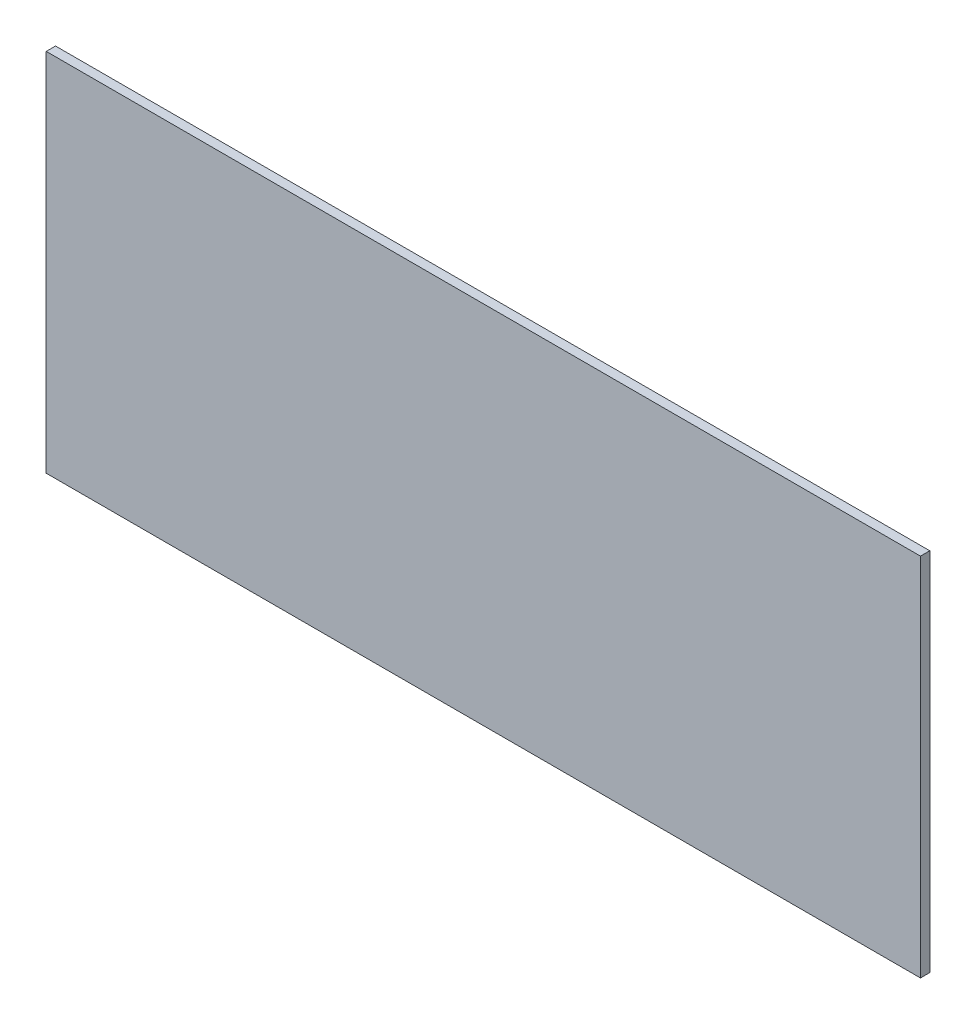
ISO-10303-21;
HEADER;
FILE_DESCRIPTION(('STEP AP214'),'2;1');
FILE_NAME('part.step','',(''),(''),'','','');
FILE_SCHEMA(('AUTOMOTIVE_DESIGN { 1 0 10303 214 1 1 1 1 }'));
ENDSEC;
DATA;
#1=APPLICATION_CONTEXT('core data for automotive mechanical design processes');
#2=APPLICATION_PROTOCOL_DEFINITION('international standard','automotive_design',2000,#1);
#3=PRODUCT_CONTEXT('',#1,'mechanical');
#4=PRODUCT('Part','Part','',(#3));
#5=PRODUCT_RELATED_PRODUCT_CATEGORY('part','',(#4));
#6=PRODUCT_DEFINITION_FORMATION('','',#4);
#7=PRODUCT_DEFINITION_CONTEXT('part definition',#1,'design');
#8=PRODUCT_DEFINITION('design','',#6,#7);
#9=PRODUCT_DEFINITION_SHAPE('','',#8);
#10=(LENGTH_UNIT() NAMED_UNIT(*) SI_UNIT(.MILLI.,.METRE.));
#11=(NAMED_UNIT(*) PLANE_ANGLE_UNIT() SI_UNIT($,.RADIAN.));
#12=(NAMED_UNIT(*) SI_UNIT($,.STERADIAN.) SOLID_ANGLE_UNIT());
#13=UNCERTAINTY_MEASURE_WITH_UNIT(LENGTH_MEASURE(1.E-05),#10,'distance_accuracy_value','');
#14=(GEOMETRIC_REPRESENTATION_CONTEXT(3) GLOBAL_UNCERTAINTY_ASSIGNED_CONTEXT((#13)) GLOBAL_UNIT_ASSIGNED_CONTEXT((#10,
#11,#12)) REPRESENTATION_CONTEXT('',''));
#15=CARTESIAN_POINT('',(0.,0.,0.));
#16=DIRECTION('',(0.,0.,1.));
#17=DIRECTION('',(1.,0.,0.));
#18=AXIS2_PLACEMENT_3D('',#15,#16,#17);
#19=CARTESIAN_POINT('',(-610.715370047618,277.550649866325,705.790752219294));
#20=DIRECTION('',(1.,0.,0.));
#21=DIRECTION('',(0.,0.,-1.));
#22=AXIS2_PLACEMENT_3D('',#19,#20,#21);
#23=PLANE('',#22);
#24=DIRECTION('',(0.,-1.,0.));
#25=VECTOR('',#24,1.);
#26=CARTESIAN_POINT('',(-610.715370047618,277.550649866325,702.615752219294));
#27=LINE('',#26,#25);
#28=CARTESIAN_POINT('',(-610.715370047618,402.212122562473,702.615752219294));
#29=VERTEX_POINT('',#28);
#30=CARTESIAN_POINT('',(-610.715370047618,277.550649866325,702.615752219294));
#31=VERTEX_POINT('',#30);
#32=EDGE_CURVE('E104',#29,#31,#27,.T.);
#33=ORIENTED_EDGE('',*,*,#32,.F.);
#34=DIRECTION('',(0.,0.,-1.));
#35=VECTOR('',#34,1.);
#36=CARTESIAN_POINT('',(-610.715370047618,402.212122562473,705.790752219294));
#37=LINE('',#36,#35);
#38=CARTESIAN_POINT('',(-610.715370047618,402.212122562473,705.790752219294));
#39=VERTEX_POINT('',#38);
#40=EDGE_CURVE('E11',#39,#29,#37,.T.);
#41=ORIENTED_EDGE('',*,*,#40,.F.);
#42=DIRECTION('',(0.,-1.,0.));
#43=VECTOR('',#42,1.);
#44=CARTESIAN_POINT('',(-610.715370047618,277.550649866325,705.790752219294));
#45=LINE('',#44,#43);
#46=CARTESIAN_POINT('',(-610.715370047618,277.550649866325,705.790752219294));
#47=VERTEX_POINT('',#46);
#48=EDGE_CURVE('E100',#39,#47,#45,.T.);
#49=ORIENTED_EDGE('',*,*,#48,.T.);
#50=DIRECTION('',(0.,0.,-1.));
#51=VECTOR('',#50,1.);
#52=CARTESIAN_POINT('',(-610.715370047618,277.550649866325,705.790752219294));
#53=LINE('',#52,#51);
#54=EDGE_CURVE('E45',#47,#31,#53,.T.);
#55=ORIENTED_EDGE('',*,*,#54,.T.);
#56=EDGE_LOOP('',(#33,#41,#49,#55));
#57=FACE_BOUND('',#56,.T.);
#58=ADVANCED_FACE('F39',(#57),#23,.T.);
#59=CARTESIAN_POINT('',(-610.715370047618,402.212122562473,705.790752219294));
#60=DIRECTION('',(0.,1.,0.));
#61=DIRECTION('',(0.,0.,1.));
#62=AXIS2_PLACEMENT_3D('',#59,#60,#61);
#63=PLANE('',#62);
#64=DIRECTION('',(1.,0.,0.));
#65=VECTOR('',#64,1.);
#66=CARTESIAN_POINT('',(-610.715370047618,402.212122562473,702.615752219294));
#67=LINE('',#66,#65);
#68=CARTESIAN_POINT('',(-909.027870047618,402.212122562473,702.615752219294));
#69=VERTEX_POINT('',#68);
#70=EDGE_CURVE('E98',#69,#29,#67,.T.);
#71=ORIENTED_EDGE('',*,*,#70,.F.);
#72=DIRECTION('',(0.,0.,-1.));
#73=VECTOR('',#72,1.);
#74=CARTESIAN_POINT('',(-909.027870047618,402.212122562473,705.790752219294));
#75=LINE('',#74,#73);
#76=CARTESIAN_POINT('',(-909.027870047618,402.212122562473,705.790752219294));
#77=VERTEX_POINT('',#76);
#78=EDGE_CURVE('E48',#77,#69,#75,.T.);
#79=ORIENTED_EDGE('',*,*,#78,.F.);
#80=DIRECTION('',(1.,0.,0.));
#81=VECTOR('',#80,1.);
#82=CARTESIAN_POINT('',(-610.715370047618,402.212122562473,705.790752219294));
#83=LINE('',#82,#81);
#84=EDGE_CURVE('E92',#77,#39,#83,.T.);
#85=ORIENTED_EDGE('',*,*,#84,.T.);
#86=ORIENTED_EDGE('',*,*,#40,.T.);
#87=EDGE_LOOP('',(#71,#79,#85,#86));
#88=FACE_BOUND('',#87,.T.);
#89=ADVANCED_FACE('F111',(#88),#63,.T.);
#90=CARTESIAN_POINT('',(-909.027870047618,277.550649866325,705.790752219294));
#91=DIRECTION('',(-1.,0.,0.));
#92=DIRECTION('',(0.,0.,1.));
#93=AXIS2_PLACEMENT_3D('',#90,#91,#92);
#94=PLANE('',#93);
#95=DIRECTION('',(0.,1.,0.));
#96=VECTOR('',#95,1.);
#97=CARTESIAN_POINT('',(-909.027870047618,277.550649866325,702.615752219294));
#98=LINE('',#97,#96);
#99=CARTESIAN_POINT('',(-909.027870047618,277.550649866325,702.615752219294));
#100=VERTEX_POINT('',#99);
#101=EDGE_CURVE('E87',#100,#69,#98,.T.);
#102=ORIENTED_EDGE('',*,*,#101,.F.);
#103=DIRECTION('',(0.,0.,-1.));
#104=VECTOR('',#103,1.);
#105=CARTESIAN_POINT('',(-909.027870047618,277.550649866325,705.790752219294));
#106=LINE('',#105,#104);
#107=CARTESIAN_POINT('',(-909.027870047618,277.550649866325,705.790752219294));
#108=VERTEX_POINT('',#107);
#109=EDGE_CURVE('E84',#108,#100,#106,.T.);
#110=ORIENTED_EDGE('',*,*,#109,.F.);
#111=DIRECTION('',(0.,1.,0.));
#112=VECTOR('',#111,1.);
#113=CARTESIAN_POINT('',(-909.027870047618,277.550649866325,705.790752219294));
#114=LINE('',#113,#112);
#115=EDGE_CURVE('E90',#108,#77,#114,.T.);
#116=ORIENTED_EDGE('',*,*,#115,.T.);
#117=ORIENTED_EDGE('',*,*,#78,.T.);
#118=EDGE_LOOP('',(#102,#110,#116,#117));
#119=FACE_BOUND('',#118,.T.);
#120=ADVANCED_FACE('F86',(#119),#94,.T.);
#121=CARTESIAN_POINT('',(-610.715370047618,277.550649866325,705.790752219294));
#122=DIRECTION('',(0.,-1.,0.));
#123=DIRECTION('',(0.,0.,-1.));
#124=AXIS2_PLACEMENT_3D('',#121,#122,#123);
#125=PLANE('',#124);
#126=DIRECTION('',(-1.,0.,0.));
#127=VECTOR('',#126,1.);
#128=CARTESIAN_POINT('',(-610.715370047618,277.550649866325,702.615752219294));
#129=LINE('',#128,#127);
#130=EDGE_CURVE('E107',#31,#100,#129,.T.);
#131=ORIENTED_EDGE('',*,*,#130,.F.);
#132=ORIENTED_EDGE('',*,*,#54,.F.);
#133=DIRECTION('',(-1.,0.,0.));
#134=VECTOR('',#133,1.);
#135=CARTESIAN_POINT('',(-610.715370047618,277.550649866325,705.790752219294));
#136=LINE('',#135,#134);
#137=EDGE_CURVE('E93',#47,#108,#136,.T.);
#138=ORIENTED_EDGE('',*,*,#137,.T.);
#139=ORIENTED_EDGE('',*,*,#109,.T.);
#140=EDGE_LOOP('',(#131,#132,#138,#139));
#141=FACE_BOUND('',#140,.T.);
#142=ADVANCED_FACE('F96',(#141),#125,.T.);
#143=CARTESIAN_POINT('',(0.,0.,705.790752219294));
#144=DIRECTION('',(0.,0.,1.));
#145=DIRECTION('',(1.,0.,0.));
#146=AXIS2_PLACEMENT_3D('',#143,#144,#145);
#147=PLANE('',#146);
#148=ORIENTED_EDGE('',*,*,#48,.F.);
#149=ORIENTED_EDGE('',*,*,#84,.F.);
#150=ORIENTED_EDGE('',*,*,#115,.F.);
#151=ORIENTED_EDGE('',*,*,#137,.F.);
#152=EDGE_LOOP('',(#148,#149,#150,#151));
#153=FACE_BOUND('',#152,.T.);
#154=ADVANCED_FACE('F95',(#153),#147,.T.);
#155=CARTESIAN_POINT('',(0.,0.,702.615752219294));
#156=DIRECTION('',(0.,0.,1.));
#157=DIRECTION('',(1.,0.,0.));
#158=AXIS2_PLACEMENT_3D('',#155,#156,#157);
#159=PLANE('',#158);
#160=ORIENTED_EDGE('',*,*,#32,.T.);
#161=ORIENTED_EDGE('',*,*,#130,.T.);
#162=ORIENTED_EDGE('',*,*,#101,.T.);
#163=ORIENTED_EDGE('',*,*,#70,.T.);
#164=EDGE_LOOP('',(#160,#161,#162,#163));
#165=FACE_BOUND('',#164,.T.);
#166=ADVANCED_FACE('F115',(#165),#159,.F.);
#167=CLOSED_SHELL('',(#58,#89,#120,#142,#154,#166));
#168=MANIFOLD_SOLID_BREP('B2',#167);
#169=ADVANCED_BREP_SHAPE_REPRESENTATION('',(#18,#168),#14);
#170=SHAPE_DEFINITION_REPRESENTATION(#9,#169);
ENDSEC;
END-ISO-10303-21;
